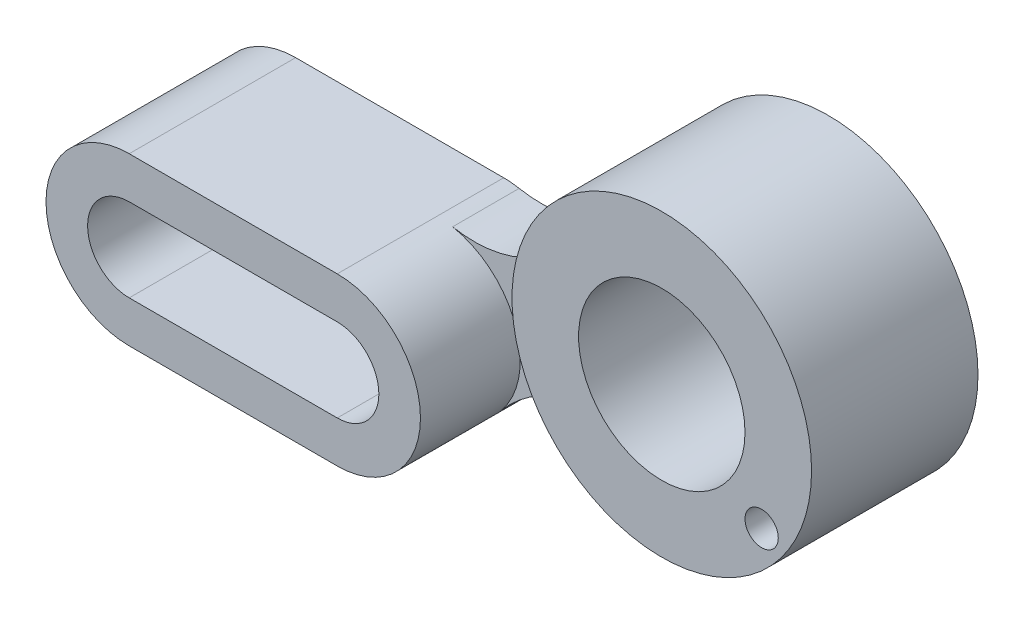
from build123d import *

# Parameters (mm, degrees)
SKETCH_1_R               = 72
SKETCH_1_R_2             = 40
EXTRUDE_1_DEPTH          = 80
EXTRUDE_2_DEPTH          = 80
EXTRUDE_3_DEPTH          = 32
CUT_EXTRUDE_1_DEPTH      = 307.620286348
CUT_EXTRUDE_1_DEPTH_BACK = 307.620286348
SKETCH_3_R               = 8


with BuildPart() as part:
    # Sketch 1 → Extrude 1 (new body)
    with BuildSketch(Plane.XY):
        Circle(SKETCH_1_R)
        Circle(SKETCH_1_R_2, mode=Mode.SUBTRACT)
    extrude(amount=EXTRUDE_1_DEPTH)



with BuildPart() as body_2:
    # Sketch 2 → Extrude 2 (new body)
    with BuildSketch(Plane.XY.offset(16)):
        with BuildLine():
            Line((-240, -16), (-140, -16))
            ThreePointArc((-140, -16), (-100, -56), (-140, -96))
            Line((-140, -96), (-240, -96))
            ThreePointArc((-240, -96), (-280, -56), (-240, -16))
        make_face()
        with BuildLine():
            Line((-240, -36), (-140, -36))
            ThreePointArc((-140, -36), (-120, -56), (-140, -76))
            Line((-140, -76), (-240, -76))
            ThreePointArc((-240, -76), (-260, -56), (-240, -36))
        make_face(mode=Mode.SUBTRACT)
    extrude(amount=EXTRUDE_2_DEPTH)


with BuildPart() as part_1:
    add(part.part)

    add(body_2.part)  # Extrude 3 merges body 2
    # Sketch 2_3 → Extrude 3 (add)
    with BuildSketch(Plane.XY.offset(16)):
        with BuildLine():
            ThreePointArc((-68.697424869, 21.556062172), (-93.349336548, -9.717106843), (-132.553648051, -16.699213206))
            ThreePointArc((-132.553648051, -16.699213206), (-102.38391175, -42.397430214), (-109.13933482, -81.448366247))
            ThreePointArc((-109.13933482, -81.448366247), (-73.299534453, -59.613833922), (-31.638849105, -64.675986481))
            ThreePointArc((-31.638849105, -64.675986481), (-66.150083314, -28.428268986), (-68.697424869, 21.556062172))
        make_face()
    extrude(amount=EXTRUDE_3_DEPTH)

    # Sketch 3 → Cut-Extrude 1 (cut, two sides: drawn at the far end of the back side and taken through both)
    with BuildSketch(Plane.XY.offset(80).offset(-CUT_EXTRUDE_1_DEPTH_BACK)):
        with Locations((48, -36)):
            Circle(SKETCH_3_R)
    extrude(amount=CUT_EXTRUDE_1_DEPTH + CUT_EXTRUDE_1_DEPTH_BACK, mode=Mode.SUBTRACT)


solid = part_1.part
